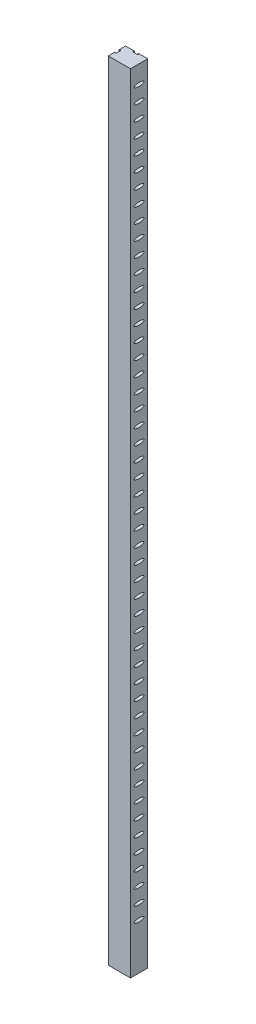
from build123d import *

# Parameters (mm, degrees)
EXTRUSION1_DEPTH           = 1600
ESQUISSE2_RX               = 10
ESQUISSE2_RY               = 3.5
EXTRUSION2_DEPTH           = 10
R_P_TITION_LIN_AIRE1_COUNT = 50
R_P_TITION_LIN_AIRE1_PITCH = 30


with BuildPart() as part:
    # Esquisse1 → Extrusion1 (new body)
    with BuildSketch(Plane(origin=(0, 0, 0), x_dir=(1, 0, 0), z_dir=(0, 1, 0))):
        Polygon((-22.5, 4), (-21.5, 4), (-21.5, 5), (-20.5, 5), (-19.5, 4), (-19.5, -4), (-20.5, -5), (-21.5, -5), (-21.5, -4), (-22.5, -4), (-22.5, -17.5), (22.5, -17.5), (22.5, 17.5), (4, 17.5), (4, 16.5), (5, 16.5), (5, 15.5), (4, 14.5), (-4, 14.5), (-5, 15.5), (-5, 16.5), (-4, 16.5), (-4, 17.5), (-22.5, 17.5), align=None)
    extrude(amount=EXTRUSION1_DEPTH)

    # Esquisse2 → Extrusion2 (cut)
    with BuildSketch(Plane(origin=(22.5, 0, 0), x_dir=(0, 0, -1), z_dir=(1, 0, 0))):
        with Locations((0, 1563.5)):
            Ellipse(ESQUISSE2_RX, ESQUISSE2_RY)
    extrusion2 = extrude(amount=-EXTRUSION2_DEPTH, mode=Mode.SUBTRACT)

    # R_p_tition lin_aire1: Extrusion2 ×50
    with Locations(*[(0, -i * R_P_TITION_LIN_AIRE1_PITCH, 0) for i in range(1, R_P_TITION_LIN_AIRE1_COUNT)]):
        add(extrusion2, mode=Mode.SUBTRACT)


solid = part.part
